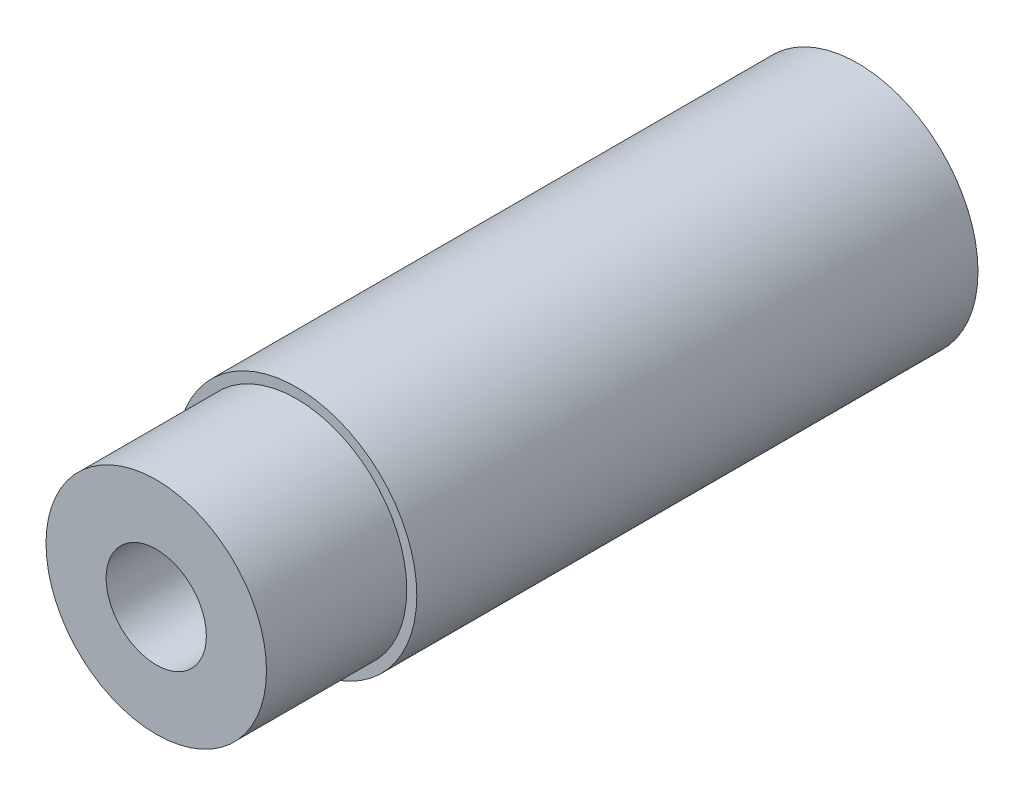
ISO-10303-21;
HEADER;
FILE_DESCRIPTION(('STEP AP214'),'2;1');
FILE_NAME('part.step','',(''),(''),'','','');
FILE_SCHEMA(('AUTOMOTIVE_DESIGN { 1 0 10303 214 1 1 1 1 }'));
ENDSEC;
DATA;
#1=APPLICATION_CONTEXT('core data for automotive mechanical design processes');
#2=APPLICATION_PROTOCOL_DEFINITION('international standard','automotive_design',2000,#1);
#3=PRODUCT_CONTEXT('',#1,'mechanical');
#4=PRODUCT('Part','Part','',(#3));
#5=PRODUCT_RELATED_PRODUCT_CATEGORY('part','',(#4));
#6=PRODUCT_DEFINITION_FORMATION('','',#4);
#7=PRODUCT_DEFINITION_CONTEXT('part definition',#1,'design');
#8=PRODUCT_DEFINITION('design','',#6,#7);
#9=PRODUCT_DEFINITION_SHAPE('','',#8);
#10=(LENGTH_UNIT() NAMED_UNIT(*) SI_UNIT(.MILLI.,.METRE.));
#11=(NAMED_UNIT(*) PLANE_ANGLE_UNIT() SI_UNIT($,.RADIAN.));
#12=(NAMED_UNIT(*) SI_UNIT($,.STERADIAN.) SOLID_ANGLE_UNIT());
#13=UNCERTAINTY_MEASURE_WITH_UNIT(LENGTH_MEASURE(1.E-05),#10,'distance_accuracy_value','');
#14=(GEOMETRIC_REPRESENTATION_CONTEXT(3) GLOBAL_UNCERTAINTY_ASSIGNED_CONTEXT((#13)) GLOBAL_UNIT_ASSIGNED_CONTEXT((#10,
#11,#12)) REPRESENTATION_CONTEXT('',''));
#15=CARTESIAN_POINT('',(0.,0.,0.));
#16=DIRECTION('',(0.,0.,1.));
#17=DIRECTION('',(1.,0.,0.));
#18=AXIS2_PLACEMENT_3D('',#15,#16,#17);
#19=CARTESIAN_POINT('',(0.346253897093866,7.41316601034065,-7.99449092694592));
#20=DIRECTION('',(0.,0.,1.));
#21=DIRECTION('',(-0.986634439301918,0.162949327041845,0.));
#22=AXIS2_PLACEMENT_3D('',#19,#20,#21);
#23=PLANE('',#22);
#24=CARTESIAN_POINT('',(-10.,0.,-7.99449092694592));
#25=DIRECTION('',(0.,0.,1.));
#26=DIRECTION('',(1.,0.,0.));
#27=AXIS2_PLACEMENT_3D('',#24,#25,#26);
#28=CIRCLE('',#27,3.);
#29=CARTESIAN_POINT('',(-7.,0.,-7.99449092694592));
#30=VERTEX_POINT('',#29);
#31=EDGE_CURVE('E10',#30,#30,#28,.T.);
#32=ORIENTED_EDGE('',*,*,#31,.T.);
#33=EDGE_LOOP('',(#32));
#34=FACE_BOUND('',#33,.T.);
#35=CARTESIAN_POINT('',(-10.,0.,-7.99449092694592));
#36=DIRECTION('',(0.,0.,1.));
#37=DIRECTION('',(1.,0.,0.));
#38=AXIS2_PLACEMENT_3D('',#35,#36,#37);
#39=CIRCLE('',#38,2.75);
#40=CARTESIAN_POINT('',(-7.25000000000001,0.,-7.99449092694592));
#41=VERTEX_POINT('',#40);
#42=EDGE_CURVE('E44',#41,#41,#39,.T.);
#43=ORIENTED_EDGE('',*,*,#42,.F.);
#44=EDGE_LOOP('',(#43));
#45=FACE_BOUND('',#44,.T.);
#46=ADVANCED_FACE('F30',(#34,#45),#23,.T.);
#47=CARTESIAN_POINT('',(-10.,0.,0.490790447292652));
#48=DIRECTION('',(0.,0.,-1.));
#49=DIRECTION('',(-1.,0.,0.));
#50=AXIS2_PLACEMENT_3D('',#47,#48,#49);
#51=CYLINDRICAL_SURFACE('',#50,3.);
#52=CARTESIAN_POINT('',(-10.,0.,-21.9944909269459));
#53=DIRECTION('',(0.,0.,1.));
#54=DIRECTION('',(1.,0.,0.));
#55=AXIS2_PLACEMENT_3D('',#52,#53,#54);
#56=CIRCLE('',#55,3.);
#57=CARTESIAN_POINT('',(-7.,0.,-21.9944909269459));
#58=VERTEX_POINT('',#57);
#59=EDGE_CURVE('E36',#58,#58,#56,.T.);
#60=ORIENTED_EDGE('',*,*,#59,.T.);
#61=EDGE_LOOP('',(#60));
#62=FACE_BOUND('',#61,.T.);
#63=ORIENTED_EDGE('',*,*,#31,.F.);
#64=EDGE_LOOP('',(#63));
#65=FACE_BOUND('',#64,.T.);
#66=ADVANCED_FACE('F72',(#62,#65),#51,.T.);
#67=CARTESIAN_POINT('',(-10.,0.,-21.9944909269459));
#68=DIRECTION('',(0.,0.,1.));
#69=DIRECTION('',(1.,0.,0.));
#70=AXIS2_PLACEMENT_3D('',#67,#68,#69);
#71=PLANE('',#70);
#72=ORIENTED_EDGE('',*,*,#59,.F.);
#73=EDGE_LOOP('',(#72));
#74=FACE_BOUND('',#73,.T.);
#75=ADVANCED_FACE('F67',(#74),#71,.F.);
#76=CARTESIAN_POINT('',(-10.,0.,-4.49449092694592));
#77=DIRECTION('',(0.,0.,-1.));
#78=DIRECTION('',(-1.,0.,0.));
#79=AXIS2_PLACEMENT_3D('',#76,#77,#78);
#80=CYLINDRICAL_SURFACE('',#79,2.75);
#81=CARTESIAN_POINT('',(-10.,0.,-4.49449092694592));
#82=DIRECTION('',(0.,0.,1.));
#83=DIRECTION('',(1.,0.,0.));
#84=AXIS2_PLACEMENT_3D('',#81,#82,#83);
#85=CIRCLE('',#84,2.75);
#86=CARTESIAN_POINT('',(-7.25000000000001,0.,-4.49449092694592));
#87=VERTEX_POINT('',#86);
#88=EDGE_CURVE('E40',#87,#87,#85,.T.);
#89=ORIENTED_EDGE('',*,*,#88,.F.);
#90=EDGE_LOOP('',(#89));
#91=FACE_BOUND('',#90,.T.);
#92=ORIENTED_EDGE('',*,*,#42,.T.);
#93=EDGE_LOOP('',(#92));
#94=FACE_BOUND('',#93,.T.);
#95=ADVANCED_FACE('F61',(#91,#94),#80,.T.);
#96=CARTESIAN_POINT('',(-10.,0.,-4.49449092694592));
#97=DIRECTION('',(0.,0.,1.));
#98=DIRECTION('',(1.,0.,0.));
#99=AXIS2_PLACEMENT_3D('',#96,#97,#98);
#100=PLANE('',#99);
#101=CARTESIAN_POINT('',(-10.,0.,-4.49449092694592));
#102=DIRECTION('',(0.,0.,1.));
#103=DIRECTION('',(1.,0.,0.));
#104=AXIS2_PLACEMENT_3D('',#101,#102,#103);
#105=CIRCLE('',#104,1.25);
#106=CARTESIAN_POINT('',(-8.75,0.,-4.49449092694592));
#107=VERTEX_POINT('',#106);
#108=EDGE_CURVE('E52',#107,#107,#105,.T.);
#109=ORIENTED_EDGE('',*,*,#108,.F.);
#110=EDGE_LOOP('',(#109));
#111=FACE_BOUND('',#110,.T.);
#112=ORIENTED_EDGE('',*,*,#88,.T.);
#113=EDGE_LOOP('',(#112));
#114=FACE_BOUND('',#113,.T.);
#115=ADVANCED_FACE('F58',(#111,#114),#100,.T.);
#116=CARTESIAN_POINT('',(-10.,0.,-7.49449092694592));
#117=DIRECTION('',(0.,0.,1.));
#118=DIRECTION('',(1.,0.,0.));
#119=AXIS2_PLACEMENT_3D('',#116,#117,#118);
#120=CYLINDRICAL_SURFACE('',#119,1.25);
#121=CARTESIAN_POINT('',(-10.,0.,-7.49449092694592));
#122=DIRECTION('',(0.,0.,1.));
#123=DIRECTION('',(1.,0.,0.));
#124=AXIS2_PLACEMENT_3D('',#121,#122,#123);
#125=CIRCLE('',#124,1.25);
#126=CARTESIAN_POINT('',(-8.75,0.,-7.49449092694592));
#127=VERTEX_POINT('',#126);
#128=EDGE_CURVE('E49',#127,#127,#125,.T.);
#129=ORIENTED_EDGE('',*,*,#128,.F.);
#130=EDGE_LOOP('',(#129));
#131=FACE_BOUND('',#130,.T.);
#132=ORIENTED_EDGE('',*,*,#108,.T.);
#133=EDGE_LOOP('',(#132));
#134=FACE_BOUND('',#133,.T.);
#135=ADVANCED_FACE('F56',(#131,#134),#120,.F.);
#136=CARTESIAN_POINT('',(-10.,0.,-7.49449092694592));
#137=DIRECTION('',(0.,0.,1.));
#138=DIRECTION('',(1.,0.,0.));
#139=AXIS2_PLACEMENT_3D('',#136,#137,#138);
#140=PLANE('',#139);
#141=ORIENTED_EDGE('',*,*,#128,.T.);
#142=EDGE_LOOP('',(#141));
#143=FACE_BOUND('',#142,.T.);
#144=ADVANCED_FACE('F85',(#143),#140,.T.);
#145=CLOSED_SHELL('',(#46,#66,#75,#95,#115,#135,#144));
#146=MANIFOLD_SOLID_BREP('B2',#145);
#147=ADVANCED_BREP_SHAPE_REPRESENTATION('',(#18,#146),#14);
#148=SHAPE_DEFINITION_REPRESENTATION(#9,#147);
ENDSEC;
END-ISO-10303-21;
